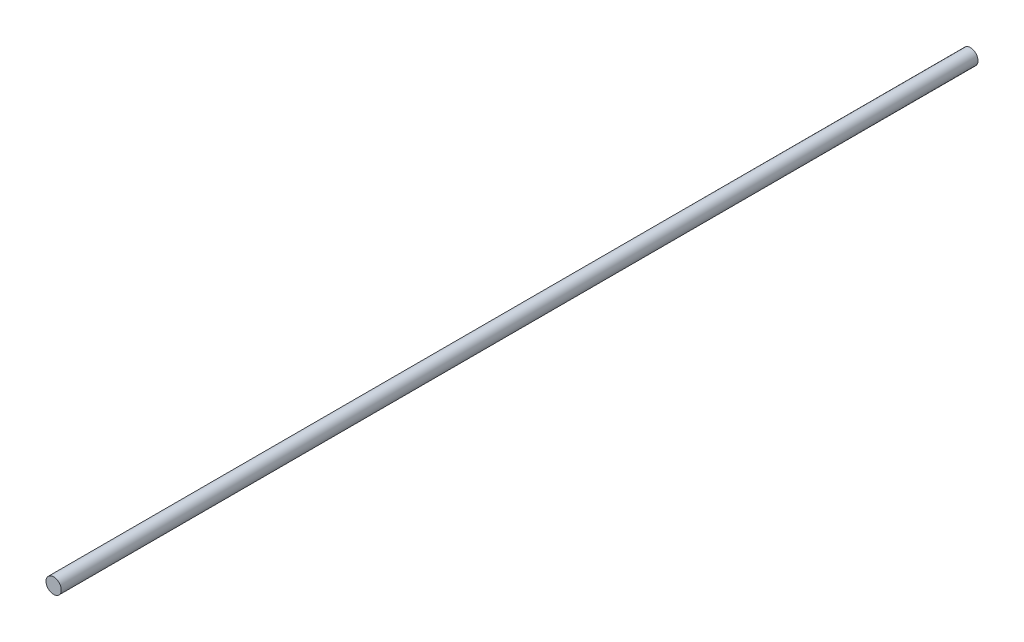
from build123d import *

# Parameters (mm, degrees)
SKETCH1_R           = 1.9812
BOSS_EXTRUDE1_DEPTH = 238.125


with BuildPart() as part:
    # Sketch1 → Boss-Extrude1 (new body)
    with BuildSketch(Plane.XY):
        with Locations((-5.372519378, 4.748081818)):
            Circle(SKETCH1_R)
    extrude(amount=BOSS_EXTRUDE1_DEPTH)


solid = part.part
